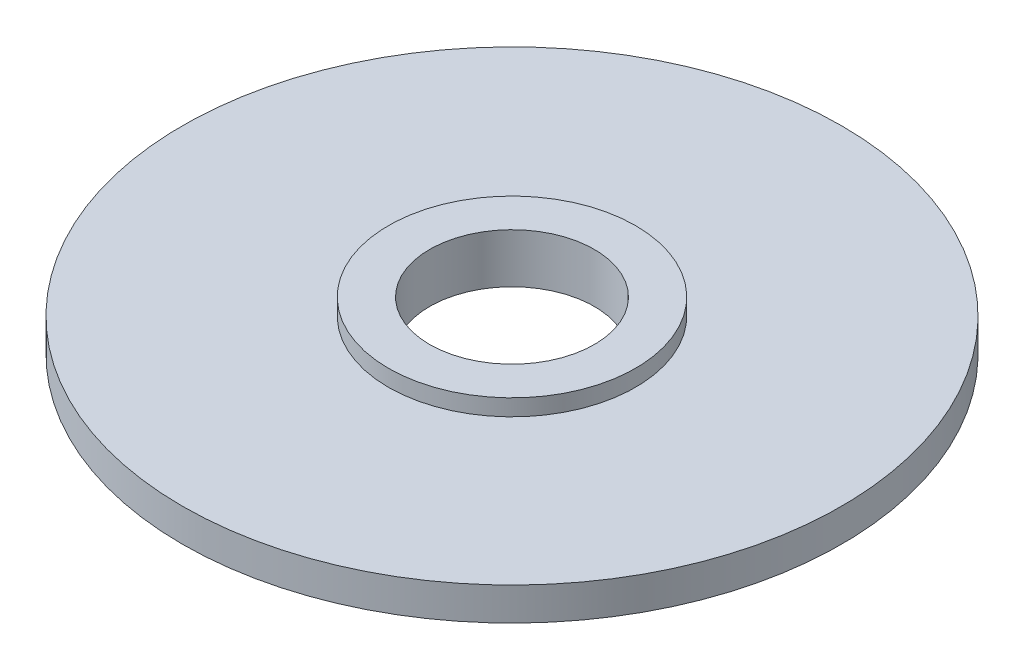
from build123d import *

# Parameters (mm, degrees)
SKETCH1_R           = 20
SKETCH1_R_2         = 7.5
BOSS_EXTRUDE1_DEPTH = 2
SKETCH1_3_R         = 7.5
SKETCH1_3_R_2       = 5
BOSS_EXTRUDE2_DEPTH = 3


with BuildPart() as part:
    # Sketch1 → Boss-Extrude1 (new body)
    with BuildSketch(Plane(origin=(0, 0, 0), x_dir=(1, 0, 0), z_dir=(0, 1, 0))):
        with Locations(Location((0, 0, 0), (0, 0, 270))):
            Circle(SKETCH1_R)
        with Locations(Location((0, 0, 0), (0, 0, 270))):
            Circle(SKETCH1_R_2, mode=Mode.SUBTRACT)
    extrude(amount=BOSS_EXTRUDE1_DEPTH)

    # Sketch1_3 → Boss-Extrude2 (add)
    with BuildSketch(Plane(origin=(0, 0, 0), x_dir=(1, 0, 0), z_dir=(0, 1, 0))):
        with Locations(Location((0, 0, 0), (0, 0, 270))):
            Circle(SKETCH1_3_R)
        with Locations(Location((0, 0, 0), (0, 0, 270))):
            Circle(SKETCH1_3_R_2, mode=Mode.SUBTRACT)
    extrude(amount=BOSS_EXTRUDE2_DEPTH)


solid = part.part
